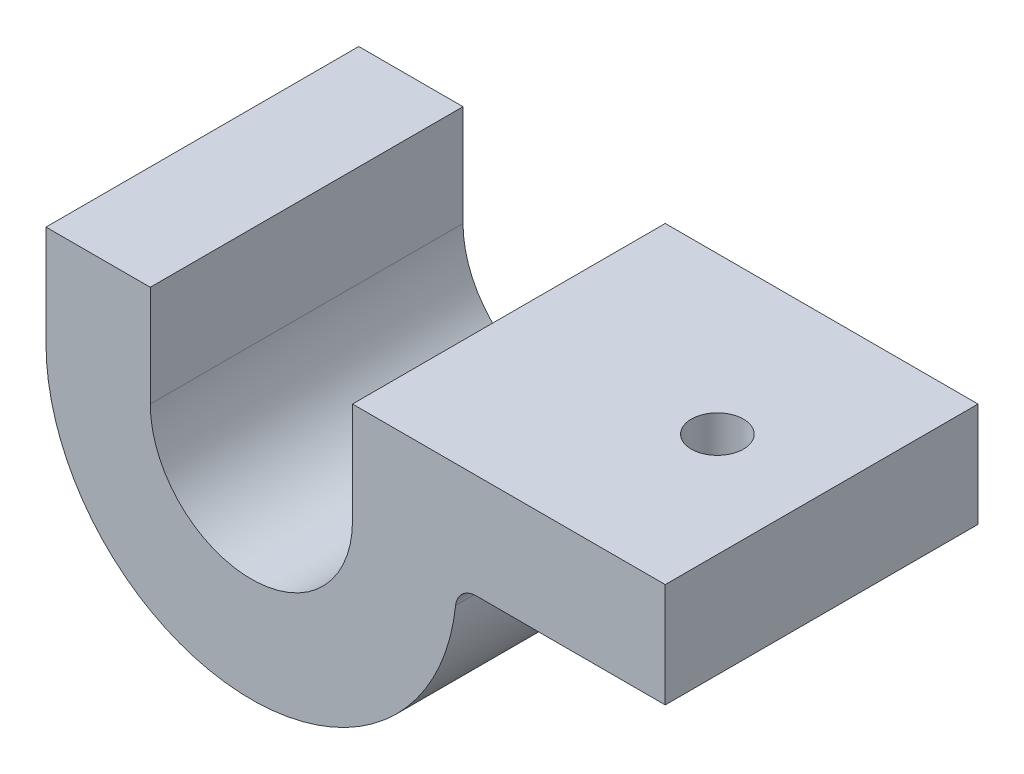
from build123d import *

# Parameters (mm, degrees)
BOSS_EXTRUDE1_DEPTH = 15
SKETCH2_R           = 1.25
CUT_EXTRUDE1_DEPTH  = 15
FILLET1_R           = 1


with BuildPart() as part:
    # Sketch1 → Boss-Extrude1 (new body)
    with BuildSketch(Plane.XY):
        with BuildLine():
            Line((-9.85, 4.85), (-9.85, 0))
            ThreePointArc((-9.85, 0), (-0.075002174, -9.849714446), (9.848857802, -0.15))
            Line((9.848857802, -0.15), (19.85, -0.15))
            Line((19.85, -0.15), (19.85, 4.85))
            Line((19.85, 4.85), (4.85, 4.85))
            Line((4.85, 4.85), (4.85, 0))
            ThreePointArc((4.85, 0), (0, -4.85), (-4.85, 0))
            Line((-4.85, 0), (-4.85, 4.85))
            Line((-4.85, 4.85), (-9.85, 4.85))
        make_face()
    extrude(amount=-BOSS_EXTRUDE1_DEPTH)

    # Sketch2 → Cut-Extrude1 (cut)
    with BuildSketch(Plane.XZ.offset(0.15)):
        with Locations(Location((14.849428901, -7.5, 0), (0, 0, 270))):
            Circle(SKETCH2_R)
    extrude(amount=-CUT_EXTRUDE1_DEPTH, mode=Mode.SUBTRACT)

    # Fillet1
    fillet1_edges = [part.edges().sort_by_distance(p)[0] for p in [
        (9.848857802, -0.15, -7.5),
    ]]
    fillet(fillet1_edges, radius=FILLET1_R)


solid = part.part
